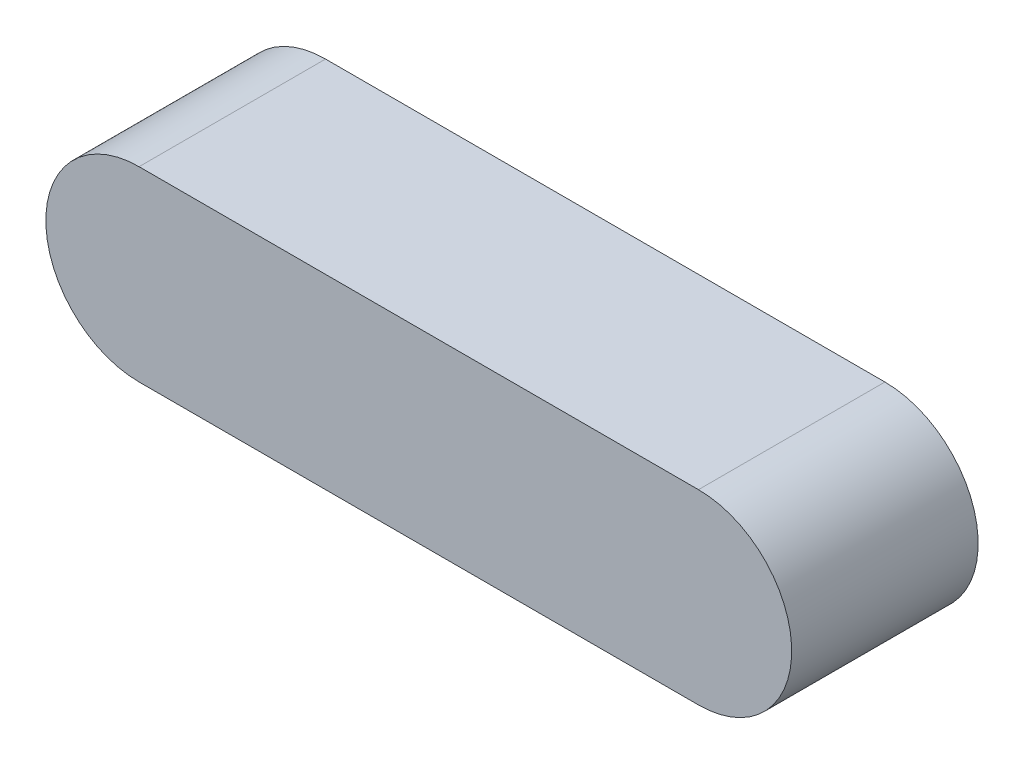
ISO-10303-21;
HEADER;
FILE_DESCRIPTION(('STEP AP214'),'2;1');
FILE_NAME('part.step','',(''),(''),'','','');
FILE_SCHEMA(('AUTOMOTIVE_DESIGN { 1 0 10303 214 1 1 1 1 }'));
ENDSEC;
DATA;
#1=APPLICATION_CONTEXT('core data for automotive mechanical design processes');
#2=APPLICATION_PROTOCOL_DEFINITION('international standard','automotive_design',2000,#1);
#3=PRODUCT_CONTEXT('',#1,'mechanical');
#4=PRODUCT('Part','Part','',(#3));
#5=PRODUCT_RELATED_PRODUCT_CATEGORY('part','',(#4));
#6=PRODUCT_DEFINITION_FORMATION('','',#4);
#7=PRODUCT_DEFINITION_CONTEXT('part definition',#1,'design');
#8=PRODUCT_DEFINITION('design','',#6,#7);
#9=PRODUCT_DEFINITION_SHAPE('','',#8);
#10=(LENGTH_UNIT() NAMED_UNIT(*) SI_UNIT(.MILLI.,.METRE.));
#11=(NAMED_UNIT(*) PLANE_ANGLE_UNIT() SI_UNIT($,.RADIAN.));
#12=(NAMED_UNIT(*) SI_UNIT($,.STERADIAN.) SOLID_ANGLE_UNIT());
#13=UNCERTAINTY_MEASURE_WITH_UNIT(LENGTH_MEASURE(1.E-05),#10,'distance_accuracy_value','');
#14=(GEOMETRIC_REPRESENTATION_CONTEXT(3) GLOBAL_UNCERTAINTY_ASSIGNED_CONTEXT((#13)) GLOBAL_UNIT_ASSIGNED_CONTEXT((#10,
#11,#12)) REPRESENTATION_CONTEXT('',''));
#15=CARTESIAN_POINT('',(0.,0.,0.));
#16=DIRECTION('',(0.,0.,1.));
#17=DIRECTION('',(1.,0.,0.));
#18=AXIS2_PLACEMENT_3D('',#15,#16,#17);
#19=CARTESIAN_POINT('',(-4.5,0.,1.5));
#20=DIRECTION('',(0.,0.,-1.));
#21=DIRECTION('',(-1.,0.,0.));
#22=AXIS2_PLACEMENT_3D('',#19,#20,#21);
#23=CYLINDRICAL_SURFACE('',#22,1.5);
#24=DIRECTION('',(0.,0.,-1.));
#25=VECTOR('',#24,1.);
#26=CARTESIAN_POINT('',(-4.5,1.49999999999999,1.5));
#27=LINE('',#26,#25);
#28=CARTESIAN_POINT('',(-4.5,1.49999999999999,1.5));
#29=VERTEX_POINT('',#28);
#30=CARTESIAN_POINT('',(-4.5,1.49999999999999,-1.5));
#31=VERTEX_POINT('',#30);
#32=EDGE_CURVE('E93',#29,#31,#27,.T.);
#33=ORIENTED_EDGE('',*,*,#32,.T.);
#34=CARTESIAN_POINT('',(-4.5,0.,-1.5));
#35=DIRECTION('',(0.,0.,1.));
#36=DIRECTION('',(1.,0.,0.));
#37=AXIS2_PLACEMENT_3D('',#34,#35,#36);
#38=CIRCLE('',#37,1.5);
#39=CARTESIAN_POINT('',(-4.5,-1.5,-1.5));
#40=VERTEX_POINT('',#39);
#41=EDGE_CURVE('E88',#31,#40,#38,.T.);
#42=ORIENTED_EDGE('',*,*,#41,.T.);
#43=DIRECTION('',(0.,0.,-1.));
#44=VECTOR('',#43,1.);
#45=CARTESIAN_POINT('',(-4.5,-1.5,1.5));
#46=LINE('',#45,#44);
#47=CARTESIAN_POINT('',(-4.5,-1.5,1.5));
#48=VERTEX_POINT('',#47);
#49=EDGE_CURVE('E11',#48,#40,#46,.T.);
#50=ORIENTED_EDGE('',*,*,#49,.F.);
#51=CARTESIAN_POINT('',(-4.5,0.,1.5));
#52=DIRECTION('',(0.,0.,1.));
#53=DIRECTION('',(1.,0.,0.));
#54=AXIS2_PLACEMENT_3D('',#51,#52,#53);
#55=CIRCLE('',#54,1.5);
#56=EDGE_CURVE('E99',#29,#48,#55,.T.);
#57=ORIENTED_EDGE('',*,*,#56,.F.);
#58=EDGE_LOOP('',(#33,#42,#50,#57));
#59=FACE_BOUND('',#58,.T.);
#60=ADVANCED_FACE('F36',(#59),#23,.T.);
#61=CARTESIAN_POINT('',(-4.5,-1.5,1.5));
#62=DIRECTION('',(0.,1.,0.));
#63=DIRECTION('',(-1.,0.,0.));
#64=AXIS2_PLACEMENT_3D('',#61,#62,#63);
#65=PLANE('',#64);
#66=ORIENTED_EDGE('',*,*,#49,.T.);
#67=DIRECTION('',(1.,0.,0.));
#68=VECTOR('',#67,1.);
#69=CARTESIAN_POINT('',(-4.5,-1.5,-1.5));
#70=LINE('',#69,#68);
#71=CARTESIAN_POINT('',(4.5,-1.5,-1.5));
#72=VERTEX_POINT('',#71);
#73=EDGE_CURVE('E78',#40,#72,#70,.T.);
#74=ORIENTED_EDGE('',*,*,#73,.T.);
#75=DIRECTION('',(0.,0.,-1.));
#76=VECTOR('',#75,1.);
#77=CARTESIAN_POINT('',(4.5,-1.5,1.5));
#78=LINE('',#77,#76);
#79=CARTESIAN_POINT('',(4.5,-1.5,1.5));
#80=VERTEX_POINT('',#79);
#81=EDGE_CURVE('E43',#80,#72,#78,.T.);
#82=ORIENTED_EDGE('',*,*,#81,.F.);
#83=DIRECTION('',(1.,0.,0.));
#84=VECTOR('',#83,1.);
#85=CARTESIAN_POINT('',(-4.5,-1.5,1.5));
#86=LINE('',#85,#84);
#87=EDGE_CURVE('E79',#48,#80,#86,.T.);
#88=ORIENTED_EDGE('',*,*,#87,.F.);
#89=EDGE_LOOP('',(#66,#74,#82,#88));
#90=FACE_BOUND('',#89,.T.);
#91=ADVANCED_FACE('F76',(#90),#65,.F.);
#92=CARTESIAN_POINT('',(4.5,0.,1.5));
#93=DIRECTION('',(0.,0.,-1.));
#94=DIRECTION('',(-1.,0.,0.));
#95=AXIS2_PLACEMENT_3D('',#92,#93,#94);
#96=CYLINDRICAL_SURFACE('',#95,1.5);
#97=ORIENTED_EDGE('',*,*,#81,.T.);
#98=CARTESIAN_POINT('',(4.5,0.,-1.5));
#99=DIRECTION('',(0.,0.,1.));
#100=DIRECTION('',(-1.,0.,0.));
#101=AXIS2_PLACEMENT_3D('',#98,#99,#100);
#102=CIRCLE('',#101,1.5);
#103=CARTESIAN_POINT('',(4.5,1.5,-1.5));
#104=VERTEX_POINT('',#103);
#105=EDGE_CURVE('E91',#72,#104,#102,.T.);
#106=ORIENTED_EDGE('',*,*,#105,.T.);
#107=DIRECTION('',(0.,0.,-1.));
#108=VECTOR('',#107,1.);
#109=CARTESIAN_POINT('',(4.5,1.5,1.5));
#110=LINE('',#109,#108);
#111=CARTESIAN_POINT('',(4.5,1.5,1.5));
#112=VERTEX_POINT('',#111);
#113=EDGE_CURVE('E105',#112,#104,#110,.T.);
#114=ORIENTED_EDGE('',*,*,#113,.F.);
#115=CARTESIAN_POINT('',(4.5,0.,1.5));
#116=DIRECTION('',(0.,0.,1.));
#117=DIRECTION('',(-1.,0.,0.));
#118=AXIS2_PLACEMENT_3D('',#115,#116,#117);
#119=CIRCLE('',#118,1.5);
#120=EDGE_CURVE('E55',#80,#112,#119,.T.);
#121=ORIENTED_EDGE('',*,*,#120,.F.);
#122=EDGE_LOOP('',(#97,#106,#114,#121));
#123=FACE_BOUND('',#122,.T.);
#124=ADVANCED_FACE('F107',(#123),#96,.T.);
#125=CARTESIAN_POINT('',(-4.5,1.49999999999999,1.5));
#126=DIRECTION('',(0.,-1.,0.));
#127=DIRECTION('',(1.,0.,0.));
#128=AXIS2_PLACEMENT_3D('',#125,#126,#127);
#129=PLANE('',#128);
#130=ORIENTED_EDGE('',*,*,#113,.T.);
#131=DIRECTION('',(-1.,0.,0.));
#132=VECTOR('',#131,1.);
#133=CARTESIAN_POINT('',(-4.5,1.49999999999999,-1.5));
#134=LINE('',#133,#132);
#135=EDGE_CURVE('E97',#104,#31,#134,.T.);
#136=ORIENTED_EDGE('',*,*,#135,.T.);
#137=ORIENTED_EDGE('',*,*,#32,.F.);
#138=DIRECTION('',(-1.,0.,0.));
#139=VECTOR('',#138,1.);
#140=CARTESIAN_POINT('',(-4.5,1.49999999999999,1.5));
#141=LINE('',#140,#139);
#142=EDGE_CURVE('E50',#112,#29,#141,.T.);
#143=ORIENTED_EDGE('',*,*,#142,.F.);
#144=EDGE_LOOP('',(#130,#136,#137,#143));
#145=FACE_BOUND('',#144,.T.);
#146=ADVANCED_FACE('F109',(#145),#129,.F.);
#147=CARTESIAN_POINT('',(-4.5,0.,1.5));
#148=DIRECTION('',(0.,0.,1.));
#149=DIRECTION('',(1.,0.,0.));
#150=AXIS2_PLACEMENT_3D('',#147,#148,#149);
#151=PLANE('',#150);
#152=ORIENTED_EDGE('',*,*,#56,.T.);
#153=ORIENTED_EDGE('',*,*,#87,.T.);
#154=ORIENTED_EDGE('',*,*,#120,.T.);
#155=ORIENTED_EDGE('',*,*,#142,.T.);
#156=EDGE_LOOP('',(#152,#153,#154,#155));
#157=FACE_BOUND('',#156,.T.);
#158=ADVANCED_FACE('F110',(#157),#151,.T.);
#159=CARTESIAN_POINT('',(-4.5,0.,-1.5));
#160=DIRECTION('',(0.,0.,1.));
#161=DIRECTION('',(1.,0.,0.));
#162=AXIS2_PLACEMENT_3D('',#159,#160,#161);
#163=PLANE('',#162);
#164=ORIENTED_EDGE('',*,*,#41,.F.);
#165=ORIENTED_EDGE('',*,*,#135,.F.);
#166=ORIENTED_EDGE('',*,*,#105,.F.);
#167=ORIENTED_EDGE('',*,*,#73,.F.);
#168=EDGE_LOOP('',(#164,#165,#166,#167));
#169=FACE_BOUND('',#168,.T.);
#170=ADVANCED_FACE('F86',(#169),#163,.F.);
#171=CLOSED_SHELL('',(#60,#91,#124,#146,#158,#170));
#172=MANIFOLD_SOLID_BREP('B2',#171);
#173=ADVANCED_BREP_SHAPE_REPRESENTATION('',(#18,#172),#14);
#174=SHAPE_DEFINITION_REPRESENTATION(#9,#173);
ENDSEC;
END-ISO-10303-21;
